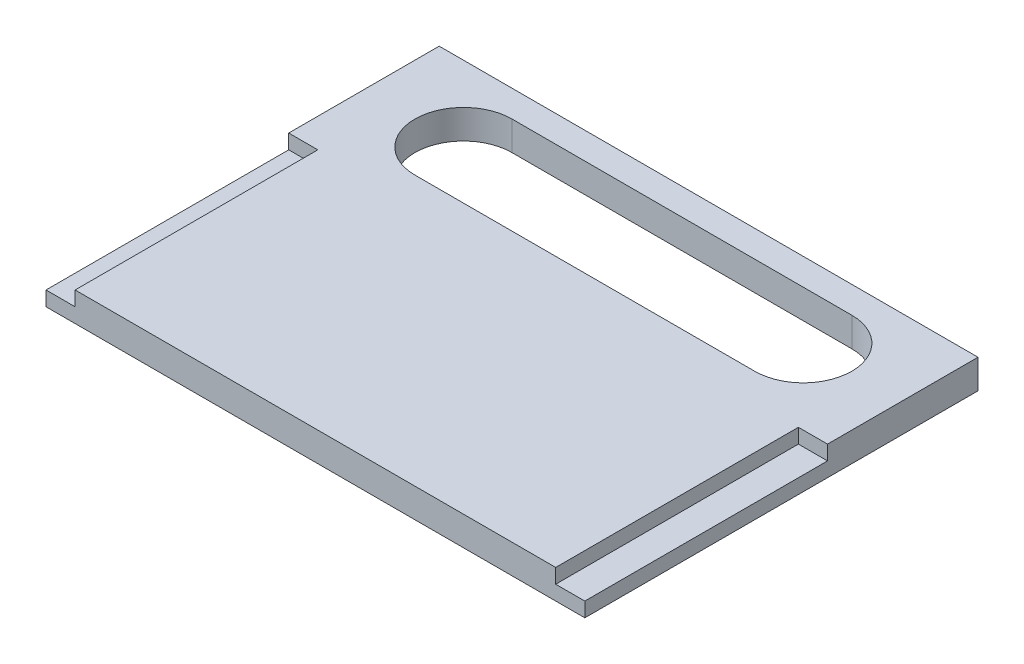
ISO-10303-21;
HEADER;
FILE_DESCRIPTION(('STEP AP214'),'2;1');
FILE_NAME('part.step','',(''),(''),'','','');
FILE_SCHEMA(('AUTOMOTIVE_DESIGN { 1 0 10303 214 1 1 1 1 }'));
ENDSEC;
DATA;
#1=APPLICATION_CONTEXT('core data for automotive mechanical design processes');
#2=APPLICATION_PROTOCOL_DEFINITION('international standard','automotive_design',2000,#1);
#3=PRODUCT_CONTEXT('',#1,'mechanical');
#4=PRODUCT('Part','Part','',(#3));
#5=PRODUCT_RELATED_PRODUCT_CATEGORY('part','',(#4));
#6=PRODUCT_DEFINITION_FORMATION('','',#4);
#7=PRODUCT_DEFINITION_CONTEXT('part definition',#1,'design');
#8=PRODUCT_DEFINITION('design','',#6,#7);
#9=PRODUCT_DEFINITION_SHAPE('','',#8);
#10=(LENGTH_UNIT() NAMED_UNIT(*) SI_UNIT(.MILLI.,.METRE.));
#11=(NAMED_UNIT(*) PLANE_ANGLE_UNIT() SI_UNIT($,.RADIAN.));
#12=(NAMED_UNIT(*) SI_UNIT($,.STERADIAN.) SOLID_ANGLE_UNIT());
#13=UNCERTAINTY_MEASURE_WITH_UNIT(LENGTH_MEASURE(1.E-05),#10,'distance_accuracy_value','');
#14=(GEOMETRIC_REPRESENTATION_CONTEXT(3) GLOBAL_UNCERTAINTY_ASSIGNED_CONTEXT((#13)) GLOBAL_UNIT_ASSIGNED_CONTEXT((#10,
#11,#12)) REPRESENTATION_CONTEXT('',''));
#15=CARTESIAN_POINT('',(0.,0.,0.));
#16=DIRECTION('',(0.,0.,1.));
#17=DIRECTION('',(1.,0.,0.));
#18=AXIS2_PLACEMENT_3D('',#15,#16,#17);
#19=CARTESIAN_POINT('',(55.5,6.,-40.5));
#20=DIRECTION('',(-1.,0.,0.));
#21=DIRECTION('',(0.,0.,1.));
#22=AXIS2_PLACEMENT_3D('',#19,#20,#21);
#23=PLANE('',#22);
#24=DIRECTION('',(0.,1.,0.));
#25=VECTOR('',#24,1.);
#26=CARTESIAN_POINT('',(55.5,3.,-9.5));
#27=LINE('',#26,#25);
#28=CARTESIAN_POINT('',(55.5,3.,-9.5));
#29=VERTEX_POINT('',#28);
#30=CARTESIAN_POINT('',(55.5,6.,-9.5));
#31=VERTEX_POINT('',#30);
#32=EDGE_CURVE('E183',#29,#31,#27,.T.);
#33=ORIENTED_EDGE('',*,*,#32,.F.);
#34=DIRECTION('',(0.,0.,1.));
#35=VECTOR('',#34,1.);
#36=CARTESIAN_POINT('',(55.5,3.,40.5));
#37=LINE('',#36,#35);
#38=CARTESIAN_POINT('',(55.5,3.,40.5));
#39=VERTEX_POINT('',#38);
#40=EDGE_CURVE('E172',#29,#39,#37,.T.);
#41=ORIENTED_EDGE('',*,*,#40,.T.);
#42=DIRECTION('',(0.,-1.,0.));
#43=VECTOR('',#42,1.);
#44=CARTESIAN_POINT('',(55.5,6.,40.5));
#45=LINE('',#44,#43);
#46=CARTESIAN_POINT('',(55.5,0.,40.5));
#47=VERTEX_POINT('',#46);
#48=EDGE_CURVE('E229',#39,#47,#45,.T.);
#49=ORIENTED_EDGE('',*,*,#48,.T.);
#50=DIRECTION('',(0.,0.,-1.));
#51=VECTOR('',#50,1.);
#52=CARTESIAN_POINT('',(55.5,0.,-40.5));
#53=LINE('',#52,#51);
#54=CARTESIAN_POINT('',(55.5,0.,-40.5));
#55=VERTEX_POINT('',#54);
#56=EDGE_CURVE('E214',#47,#55,#53,.T.);
#57=ORIENTED_EDGE('',*,*,#56,.T.);
#58=DIRECTION('',(0.,-1.,0.));
#59=VECTOR('',#58,1.);
#60=CARTESIAN_POINT('',(55.5,6.,-40.5));
#61=LINE('',#60,#59);
#62=CARTESIAN_POINT('',(55.5,6.,-40.5));
#63=VERTEX_POINT('',#62);
#64=EDGE_CURVE('E11',#63,#55,#61,.T.);
#65=ORIENTED_EDGE('',*,*,#64,.F.);
#66=DIRECTION('',(0.,0.,-1.));
#67=VECTOR('',#66,1.);
#68=CARTESIAN_POINT('',(55.5,6.,-40.5));
#69=LINE('',#68,#67);
#70=EDGE_CURVE('E218',#31,#63,#69,.T.);
#71=ORIENTED_EDGE('',*,*,#70,.F.);
#72=EDGE_LOOP('',(#33,#41,#49,#57,#65,#71));
#73=FACE_BOUND('',#72,.T.);
#74=ADVANCED_FACE('F35',(#73),#23,.F.);
#75=CARTESIAN_POINT('',(-55.5,6.,40.5));
#76=DIRECTION('',(0.,0.,-1.));
#77=DIRECTION('',(-1.,0.,0.));
#78=AXIS2_PLACEMENT_3D('',#75,#76,#77);
#79=PLANE('',#78);
#80=DIRECTION('',(0.,1.,0.));
#81=VECTOR('',#80,1.);
#82=CARTESIAN_POINT('',(49.5,3.,40.5));
#83=LINE('',#82,#81);
#84=CARTESIAN_POINT('',(49.5,3.,40.5));
#85=VERTEX_POINT('',#84);
#86=CARTESIAN_POINT('',(49.5,6.,40.5));
#87=VERTEX_POINT('',#86);
#88=EDGE_CURVE('E188',#85,#87,#83,.T.);
#89=ORIENTED_EDGE('',*,*,#88,.T.);
#90=DIRECTION('',(1.,0.,0.));
#91=VECTOR('',#90,1.);
#92=CARTESIAN_POINT('',(-55.5,6.,40.5));
#93=LINE('',#92,#91);
#94=CARTESIAN_POINT('',(-49.5,6.,40.5));
#95=VERTEX_POINT('',#94);
#96=EDGE_CURVE('E226',#95,#87,#93,.T.);
#97=ORIENTED_EDGE('',*,*,#96,.F.);
#98=DIRECTION('',(0.,1.,0.));
#99=VECTOR('',#98,1.);
#100=CARTESIAN_POINT('',(-49.5,3.,40.5));
#101=LINE('',#100,#99);
#102=CARTESIAN_POINT('',(-49.5,3.,40.5));
#103=VERTEX_POINT('',#102);
#104=EDGE_CURVE('E207',#103,#95,#101,.T.);
#105=ORIENTED_EDGE('',*,*,#104,.F.);
#106=DIRECTION('',(1.,0.,0.));
#107=VECTOR('',#106,1.);
#108=CARTESIAN_POINT('',(-55.5,3.,40.5));
#109=LINE('',#108,#107);
#110=CARTESIAN_POINT('',(-55.5,3.,40.5));
#111=VERTEX_POINT('',#110);
#112=EDGE_CURVE('E197',#111,#103,#109,.T.);
#113=ORIENTED_EDGE('',*,*,#112,.F.);
#114=DIRECTION('',(0.,-1.,0.));
#115=VECTOR('',#114,1.);
#116=CARTESIAN_POINT('',(-55.5,6.,40.5));
#117=LINE('',#116,#115);
#118=CARTESIAN_POINT('',(-55.5,0.,40.5));
#119=VERTEX_POINT('',#118);
#120=EDGE_CURVE('E240',#111,#119,#117,.T.);
#121=ORIENTED_EDGE('',*,*,#120,.T.);
#122=DIRECTION('',(1.,0.,0.));
#123=VECTOR('',#122,1.);
#124=CARTESIAN_POINT('',(-55.5,0.,40.5));
#125=LINE('',#124,#123);
#126=EDGE_CURVE('E221',#119,#47,#125,.T.);
#127=ORIENTED_EDGE('',*,*,#126,.T.);
#128=ORIENTED_EDGE('',*,*,#48,.F.);
#129=DIRECTION('',(-1.,0.,0.));
#130=VECTOR('',#129,1.);
#131=CARTESIAN_POINT('',(55.5,3.,40.5));
#132=LINE('',#131,#130);
#133=EDGE_CURVE('E180',#39,#85,#132,.T.);
#134=ORIENTED_EDGE('',*,*,#133,.T.);
#135=EDGE_LOOP('',(#89,#97,#105,#113,#121,#127,#128,#134));
#136=FACE_BOUND('',#135,.T.);
#137=ADVANCED_FACE('F255',(#136),#79,.F.);
#138=CARTESIAN_POINT('',(0.,6.,0.));
#139=DIRECTION('',(0.,1.,0.));
#140=DIRECTION('',(0.,0.,1.));
#141=AXIS2_PLACEMENT_3D('',#138,#139,#140);
#142=PLANE('',#141);
#143=CARTESIAN_POINT('',(-35.,6.,-25.));
#144=DIRECTION('',(0.,1.,0.));
#145=DIRECTION('',(0.,0.,1.));
#146=AXIS2_PLACEMENT_3D('',#143,#144,#145);
#147=CIRCLE('',#146,10.);
#148=CARTESIAN_POINT('',(-35.,6.,-35.));
#149=VERTEX_POINT('',#148);
#150=CARTESIAN_POINT('',(-35.,6.,-15.));
#151=VERTEX_POINT('',#150);
#152=EDGE_CURVE('E49',#149,#151,#147,.T.);
#153=ORIENTED_EDGE('',*,*,#152,.F.);
#154=DIRECTION('',(-1.,0.,0.));
#155=VECTOR('',#154,1.);
#156=CARTESIAN_POINT('',(-35.,6.,-35.));
#157=LINE('',#156,#155);
#158=CARTESIAN_POINT('',(35.,6.,-35.));
#159=VERTEX_POINT('',#158);
#160=EDGE_CURVE('E153',#159,#149,#157,.T.);
#161=ORIENTED_EDGE('',*,*,#160,.F.);
#162=CARTESIAN_POINT('',(35.,6.,-25.));
#163=DIRECTION('',(0.,1.,0.));
#164=DIRECTION('',(0.,0.,1.));
#165=AXIS2_PLACEMENT_3D('',#162,#163,#164);
#166=CIRCLE('',#165,10.);
#167=CARTESIAN_POINT('',(35.,6.,-15.));
#168=VERTEX_POINT('',#167);
#169=EDGE_CURVE('E156',#168,#159,#166,.T.);
#170=ORIENTED_EDGE('',*,*,#169,.F.);
#171=DIRECTION('',(1.,0.,0.));
#172=VECTOR('',#171,1.);
#173=CARTESIAN_POINT('',(-35.,6.,-15.));
#174=LINE('',#173,#172);
#175=EDGE_CURVE('E162',#151,#168,#174,.T.);
#176=ORIENTED_EDGE('',*,*,#175,.F.);
#177=EDGE_LOOP('',(#153,#161,#170,#176));
#178=FACE_BOUND('',#177,.T.);
#179=ORIENTED_EDGE('',*,*,#96,.T.);
#180=DIRECTION('',(0.,0.,-1.));
#181=VECTOR('',#180,1.);
#182=CARTESIAN_POINT('',(49.5,6.,40.5));
#183=LINE('',#182,#181);
#184=CARTESIAN_POINT('',(49.5,6.,-9.5));
#185=VERTEX_POINT('',#184);
#186=EDGE_CURVE('E176',#87,#185,#183,.T.);
#187=ORIENTED_EDGE('',*,*,#186,.T.);
#188=DIRECTION('',(1.,0.,0.));
#189=VECTOR('',#188,1.);
#190=CARTESIAN_POINT('',(55.5,6.,-9.5));
#191=LINE('',#190,#189);
#192=EDGE_CURVE('E168',#185,#31,#191,.T.);
#193=ORIENTED_EDGE('',*,*,#192,.T.);
#194=ORIENTED_EDGE('',*,*,#70,.T.);
#195=DIRECTION('',(-1.,0.,0.));
#196=VECTOR('',#195,1.);
#197=CARTESIAN_POINT('',(-55.5,6.,-40.5));
#198=LINE('',#197,#196);
#199=CARTESIAN_POINT('',(-55.5,6.,-40.5));
#200=VERTEX_POINT('',#199);
#201=EDGE_CURVE('E220',#63,#200,#198,.T.);
#202=ORIENTED_EDGE('',*,*,#201,.T.);
#203=DIRECTION('',(0.,0.,1.));
#204=VECTOR('',#203,1.);
#205=CARTESIAN_POINT('',(-55.5,6.,-40.5));
#206=LINE('',#205,#204);
#207=CARTESIAN_POINT('',(-55.5,6.,-9.5));
#208=VERTEX_POINT('',#207);
#209=EDGE_CURVE('E223',#200,#208,#206,.T.);
#210=ORIENTED_EDGE('',*,*,#209,.T.);
#211=DIRECTION('',(-1.,0.,0.));
#212=VECTOR('',#211,1.);
#213=CARTESIAN_POINT('',(-55.5,6.,-9.5));
#214=LINE('',#213,#212);
#215=CARTESIAN_POINT('',(-49.5,6.,-9.5));
#216=VERTEX_POINT('',#215);
#217=EDGE_CURVE('E198',#216,#208,#214,.T.);
#218=ORIENTED_EDGE('',*,*,#217,.F.);
#219=DIRECTION('',(0.,0.,-1.));
#220=VECTOR('',#219,1.);
#221=CARTESIAN_POINT('',(-49.5,6.,40.5));
#222=LINE('',#221,#220);
#223=EDGE_CURVE('E191',#95,#216,#222,.T.);
#224=ORIENTED_EDGE('',*,*,#223,.F.);
#225=EDGE_LOOP('',(#179,#187,#193,#194,#202,#210,#218,#224));
#226=FACE_BOUND('',#225,.T.);
#227=ADVANCED_FACE('F266',(#178,#226),#142,.T.);
#228=CARTESIAN_POINT('',(-55.5,6.,-40.5));
#229=DIRECTION('',(0.,0.,1.));
#230=DIRECTION('',(1.,0.,0.));
#231=AXIS2_PLACEMENT_3D('',#228,#229,#230);
#232=PLANE('',#231);
#233=DIRECTION('',(-1.,0.,0.));
#234=VECTOR('',#233,1.);
#235=CARTESIAN_POINT('',(-55.5,0.,-40.5));
#236=LINE('',#235,#234);
#237=CARTESIAN_POINT('',(-55.5,0.,-40.5));
#238=VERTEX_POINT('',#237);
#239=EDGE_CURVE('E232',#55,#238,#236,.T.);
#240=ORIENTED_EDGE('',*,*,#239,.T.);
#241=DIRECTION('',(0.,-1.,0.));
#242=VECTOR('',#241,1.);
#243=CARTESIAN_POINT('',(-55.5,6.,-40.5));
#244=LINE('',#243,#242);
#245=EDGE_CURVE('E42',#200,#238,#244,.T.);
#246=ORIENTED_EDGE('',*,*,#245,.F.);
#247=ORIENTED_EDGE('',*,*,#201,.F.);
#248=ORIENTED_EDGE('',*,*,#64,.T.);
#249=EDGE_LOOP('',(#240,#246,#247,#248));
#250=FACE_BOUND('',#249,.T.);
#251=ADVANCED_FACE('F270',(#250),#232,.F.);
#252=CARTESIAN_POINT('',(-55.5,6.,-40.5));
#253=DIRECTION('',(1.,0.,0.));
#254=DIRECTION('',(0.,0.,-1.));
#255=AXIS2_PLACEMENT_3D('',#252,#253,#254);
#256=PLANE('',#255);
#257=DIRECTION('',(0.,0.,1.));
#258=VECTOR('',#257,1.);
#259=CARTESIAN_POINT('',(-55.5,3.,40.5));
#260=LINE('',#259,#258);
#261=CARTESIAN_POINT('',(-55.5,3.,-9.5));
#262=VERTEX_POINT('',#261);
#263=EDGE_CURVE('E195',#262,#111,#260,.T.);
#264=ORIENTED_EDGE('',*,*,#263,.F.);
#265=DIRECTION('',(0.,1.,0.));
#266=VECTOR('',#265,1.);
#267=CARTESIAN_POINT('',(-55.5,3.,-9.5));
#268=LINE('',#267,#266);
#269=EDGE_CURVE('E211',#262,#208,#268,.T.);
#270=ORIENTED_EDGE('',*,*,#269,.T.);
#271=ORIENTED_EDGE('',*,*,#209,.F.);
#272=ORIENTED_EDGE('',*,*,#245,.T.);
#273=DIRECTION('',(0.,0.,1.));
#274=VECTOR('',#273,1.);
#275=CARTESIAN_POINT('',(-55.5,0.,-40.5));
#276=LINE('',#275,#274);
#277=EDGE_CURVE('E234',#238,#119,#276,.T.);
#278=ORIENTED_EDGE('',*,*,#277,.T.);
#279=ORIENTED_EDGE('',*,*,#120,.F.);
#280=EDGE_LOOP('',(#264,#270,#271,#272,#278,#279));
#281=FACE_BOUND('',#280,.T.);
#282=ADVANCED_FACE('F247',(#281),#256,.F.);
#283=CARTESIAN_POINT('',(0.,0.,0.));
#284=DIRECTION('',(0.,1.,0.));
#285=DIRECTION('',(0.,0.,1.));
#286=AXIS2_PLACEMENT_3D('',#283,#284,#285);
#287=PLANE('',#286);
#288=DIRECTION('',(-1.,0.,0.));
#289=VECTOR('',#288,1.);
#290=CARTESIAN_POINT('',(-35.,0.,-35.));
#291=LINE('',#290,#289);
#292=CARTESIAN_POINT('',(35.,0.,-35.));
#293=VERTEX_POINT('',#292);
#294=CARTESIAN_POINT('',(-35.,0.,-35.));
#295=VERTEX_POINT('',#294);
#296=EDGE_CURVE('E143',#293,#295,#291,.T.);
#297=ORIENTED_EDGE('',*,*,#296,.T.);
#298=CARTESIAN_POINT('',(-35.,0.,-25.));
#299=DIRECTION('',(0.,1.,0.));
#300=DIRECTION('',(0.,0.,1.));
#301=AXIS2_PLACEMENT_3D('',#298,#299,#300);
#302=CIRCLE('',#301,10.);
#303=CARTESIAN_POINT('',(-35.,0.,-15.));
#304=VERTEX_POINT('',#303);
#305=EDGE_CURVE('E137',#295,#304,#302,.T.);
#306=ORIENTED_EDGE('',*,*,#305,.T.);
#307=DIRECTION('',(1.,0.,0.));
#308=VECTOR('',#307,1.);
#309=CARTESIAN_POINT('',(-35.,0.,-15.));
#310=LINE('',#309,#308);
#311=CARTESIAN_POINT('',(35.,0.,-15.));
#312=VERTEX_POINT('',#311);
#313=EDGE_CURVE('E146',#304,#312,#310,.T.);
#314=ORIENTED_EDGE('',*,*,#313,.T.);
#315=CARTESIAN_POINT('',(35.,0.,-25.));
#316=DIRECTION('',(0.,1.,0.));
#317=DIRECTION('',(0.,0.,1.));
#318=AXIS2_PLACEMENT_3D('',#315,#316,#317);
#319=CIRCLE('',#318,10.);
#320=EDGE_CURVE('E57',#312,#293,#319,.T.);
#321=ORIENTED_EDGE('',*,*,#320,.T.);
#322=EDGE_LOOP('',(#297,#306,#314,#321));
#323=FACE_BOUND('',#322,.T.);
#324=ORIENTED_EDGE('',*,*,#56,.F.);
#325=ORIENTED_EDGE('',*,*,#126,.F.);
#326=ORIENTED_EDGE('',*,*,#277,.F.);
#327=ORIENTED_EDGE('',*,*,#239,.F.);
#328=EDGE_LOOP('',(#324,#325,#326,#327));
#329=FACE_BOUND('',#328,.T.);
#330=ADVANCED_FACE('F150',(#323,#329),#287,.F.);
#331=CARTESIAN_POINT('',(-55.5,3.,-9.5));
#332=DIRECTION('',(0.,0.,-1.));
#333=DIRECTION('',(-1.,0.,0.));
#334=AXIS2_PLACEMENT_3D('',#331,#332,#333);
#335=PLANE('',#334);
#336=ORIENTED_EDGE('',*,*,#217,.T.);
#337=ORIENTED_EDGE('',*,*,#269,.F.);
#338=DIRECTION('',(-1.,0.,0.));
#339=VECTOR('',#338,1.);
#340=CARTESIAN_POINT('',(-55.5,3.,-9.5));
#341=LINE('',#340,#339);
#342=CARTESIAN_POINT('',(-49.5,3.,-9.5));
#343=VERTEX_POINT('',#342);
#344=EDGE_CURVE('E204',#343,#262,#341,.T.);
#345=ORIENTED_EDGE('',*,*,#344,.F.);
#346=DIRECTION('',(0.,1.,0.));
#347=VECTOR('',#346,1.);
#348=CARTESIAN_POINT('',(-49.5,3.,-9.5));
#349=LINE('',#348,#347);
#350=EDGE_CURVE('E215',#343,#216,#349,.T.);
#351=ORIENTED_EDGE('',*,*,#350,.T.);
#352=EDGE_LOOP('',(#336,#337,#345,#351));
#353=FACE_BOUND('',#352,.T.);
#354=ADVANCED_FACE('F262',(#353),#335,.F.);
#355=CARTESIAN_POINT('',(-49.5,3.,40.5));
#356=DIRECTION('',(1.,0.,0.));
#357=DIRECTION('',(0.,0.,-1.));
#358=AXIS2_PLACEMENT_3D('',#355,#356,#357);
#359=PLANE('',#358);
#360=ORIENTED_EDGE('',*,*,#223,.T.);
#361=ORIENTED_EDGE('',*,*,#350,.F.);
#362=DIRECTION('',(0.,0.,-1.));
#363=VECTOR('',#362,1.);
#364=CARTESIAN_POINT('',(-49.5,3.,40.5));
#365=LINE('',#364,#363);
#366=EDGE_CURVE('E201',#103,#343,#365,.T.);
#367=ORIENTED_EDGE('',*,*,#366,.F.);
#368=ORIENTED_EDGE('',*,*,#104,.T.);
#369=EDGE_LOOP('',(#360,#361,#367,#368));
#370=FACE_BOUND('',#369,.T.);
#371=ADVANCED_FACE('F327',(#370),#359,.F.);
#372=CARTESIAN_POINT('',(0.,3.,0.));
#373=DIRECTION('',(0.,-1.,0.));
#374=DIRECTION('',(0.,0.,-1.));
#375=AXIS2_PLACEMENT_3D('',#372,#373,#374);
#376=PLANE('',#375);
#377=ORIENTED_EDGE('',*,*,#263,.T.);
#378=ORIENTED_EDGE('',*,*,#112,.T.);
#379=ORIENTED_EDGE('',*,*,#366,.T.);
#380=ORIENTED_EDGE('',*,*,#344,.T.);
#381=EDGE_LOOP('',(#377,#378,#379,#380));
#382=FACE_BOUND('',#381,.T.);
#383=ADVANCED_FACE('F259',(#382),#376,.F.);
#384=CARTESIAN_POINT('',(49.5,3.,40.5));
#385=DIRECTION('',(1.,0.,0.));
#386=DIRECTION('',(0.,0.,-1.));
#387=AXIS2_PLACEMENT_3D('',#384,#385,#386);
#388=PLANE('',#387);
#389=ORIENTED_EDGE('',*,*,#186,.F.);
#390=ORIENTED_EDGE('',*,*,#88,.F.);
#391=DIRECTION('',(0.,0.,-1.));
#392=VECTOR('',#391,1.);
#393=CARTESIAN_POINT('',(49.5,3.,40.5));
#394=LINE('',#393,#392);
#395=CARTESIAN_POINT('',(49.5,3.,-9.5));
#396=VERTEX_POINT('',#395);
#397=EDGE_CURVE('E178',#85,#396,#394,.T.);
#398=ORIENTED_EDGE('',*,*,#397,.T.);
#399=DIRECTION('',(0.,1.,0.));
#400=VECTOR('',#399,1.);
#401=CARTESIAN_POINT('',(49.5,3.,-9.5));
#402=LINE('',#401,#400);
#403=EDGE_CURVE('E192',#396,#185,#402,.T.);
#404=ORIENTED_EDGE('',*,*,#403,.T.);
#405=EDGE_LOOP('',(#389,#390,#398,#404));
#406=FACE_BOUND('',#405,.T.);
#407=ADVANCED_FACE('F280',(#406),#388,.T.);
#408=CARTESIAN_POINT('',(55.5,3.,-9.5));
#409=DIRECTION('',(0.,0.,1.));
#410=DIRECTION('',(1.,0.,0.));
#411=AXIS2_PLACEMENT_3D('',#408,#409,#410);
#412=PLANE('',#411);
#413=ORIENTED_EDGE('',*,*,#192,.F.);
#414=ORIENTED_EDGE('',*,*,#403,.F.);
#415=DIRECTION('',(1.,0.,0.));
#416=VECTOR('',#415,1.);
#417=CARTESIAN_POINT('',(55.5,3.,-9.5));
#418=LINE('',#417,#416);
#419=EDGE_CURVE('E175',#396,#29,#418,.T.);
#420=ORIENTED_EDGE('',*,*,#419,.T.);
#421=ORIENTED_EDGE('',*,*,#32,.T.);
#422=EDGE_LOOP('',(#413,#414,#420,#421));
#423=FACE_BOUND('',#422,.T.);
#424=ADVANCED_FACE('F283',(#423),#412,.T.);
#425=CARTESIAN_POINT('',(0.,3.,0.));
#426=DIRECTION('',(0.,-1.,0.));
#427=DIRECTION('',(0.,0.,-1.));
#428=AXIS2_PLACEMENT_3D('',#425,#426,#427);
#429=PLANE('',#428);
#430=ORIENTED_EDGE('',*,*,#40,.F.);
#431=ORIENTED_EDGE('',*,*,#419,.F.);
#432=ORIENTED_EDGE('',*,*,#397,.F.);
#433=ORIENTED_EDGE('',*,*,#133,.F.);
#434=EDGE_LOOP('',(#430,#431,#432,#433));
#435=FACE_BOUND('',#434,.T.);
#436=ADVANCED_FACE('F276',(#435),#429,.F.);
#437=CARTESIAN_POINT('',(-35.,0.,-25.));
#438=DIRECTION('',(0.,1.,0.));
#439=DIRECTION('',(0.,0.,1.));
#440=AXIS2_PLACEMENT_3D('',#437,#438,#439);
#441=CYLINDRICAL_SURFACE('',#440,10.);
#442=ORIENTED_EDGE('',*,*,#152,.T.);
#443=DIRECTION('',(0.,1.,0.));
#444=VECTOR('',#443,1.);
#445=CARTESIAN_POINT('',(-35.,0.,-15.));
#446=LINE('',#445,#444);
#447=EDGE_CURVE('E133',#304,#151,#446,.T.);
#448=ORIENTED_EDGE('',*,*,#447,.F.);
#449=ORIENTED_EDGE('',*,*,#305,.F.);
#450=DIRECTION('',(0.,1.,0.));
#451=VECTOR('',#450,1.);
#452=CARTESIAN_POINT('',(-35.,0.,-35.));
#453=LINE('',#452,#451);
#454=EDGE_CURVE('E166',#295,#149,#453,.T.);
#455=ORIENTED_EDGE('',*,*,#454,.T.);
#456=EDGE_LOOP('',(#442,#448,#449,#455));
#457=FACE_BOUND('',#456,.T.);
#458=ADVANCED_FACE('F135',(#457),#441,.F.);
#459=CARTESIAN_POINT('',(-35.,0.,-35.));
#460=DIRECTION('',(0.,0.,-1.));
#461=DIRECTION('',(-1.,0.,0.));
#462=AXIS2_PLACEMENT_3D('',#459,#460,#461);
#463=PLANE('',#462);
#464=ORIENTED_EDGE('',*,*,#160,.T.);
#465=ORIENTED_EDGE('',*,*,#454,.F.);
#466=ORIENTED_EDGE('',*,*,#296,.F.);
#467=DIRECTION('',(0.,1.,0.));
#468=VECTOR('',#467,1.);
#469=CARTESIAN_POINT('',(35.,0.,-35.));
#470=LINE('',#469,#468);
#471=EDGE_CURVE('E169',#293,#159,#470,.T.);
#472=ORIENTED_EDGE('',*,*,#471,.T.);
#473=EDGE_LOOP('',(#464,#465,#466,#472));
#474=FACE_BOUND('',#473,.T.);
#475=ADVANCED_FACE('F386',(#474),#463,.F.);
#476=CARTESIAN_POINT('',(35.,0.,-25.));
#477=DIRECTION('',(0.,1.,0.));
#478=DIRECTION('',(0.,0.,1.));
#479=AXIS2_PLACEMENT_3D('',#476,#477,#478);
#480=CYLINDRICAL_SURFACE('',#479,10.);
#481=ORIENTED_EDGE('',*,*,#169,.T.);
#482=ORIENTED_EDGE('',*,*,#471,.F.);
#483=ORIENTED_EDGE('',*,*,#320,.F.);
#484=DIRECTION('',(0.,1.,0.));
#485=VECTOR('',#484,1.);
#486=CARTESIAN_POINT('',(35.,0.,-15.));
#487=LINE('',#486,#485);
#488=EDGE_CURVE('E142',#312,#168,#487,.T.);
#489=ORIENTED_EDGE('',*,*,#488,.T.);
#490=EDGE_LOOP('',(#481,#482,#483,#489));
#491=FACE_BOUND('',#490,.T.);
#492=ADVANCED_FACE('F392',(#491),#480,.F.);
#493=CARTESIAN_POINT('',(-35.,0.,-15.));
#494=DIRECTION('',(0.,0.,1.));
#495=DIRECTION('',(1.,0.,0.));
#496=AXIS2_PLACEMENT_3D('',#493,#494,#495);
#497=PLANE('',#496);
#498=ORIENTED_EDGE('',*,*,#175,.T.);
#499=ORIENTED_EDGE('',*,*,#488,.F.);
#500=ORIENTED_EDGE('',*,*,#313,.F.);
#501=ORIENTED_EDGE('',*,*,#447,.T.);
#502=EDGE_LOOP('',(#498,#499,#500,#501));
#503=FACE_BOUND('',#502,.T.);
#504=ADVANCED_FACE('F147',(#503),#497,.F.);
#505=CLOSED_SHELL('',(#74,#137,#227,#251,#282,#330,#354,#371,#383,#407,#424,#436,#458,#475,#492,#504));
#506=MANIFOLD_SOLID_BREP('B2',#505);
#507=ADVANCED_BREP_SHAPE_REPRESENTATION('',(#18,#506),#14);
#508=SHAPE_DEFINITION_REPRESENTATION(#9,#507);
ENDSEC;
END-ISO-10303-21;
